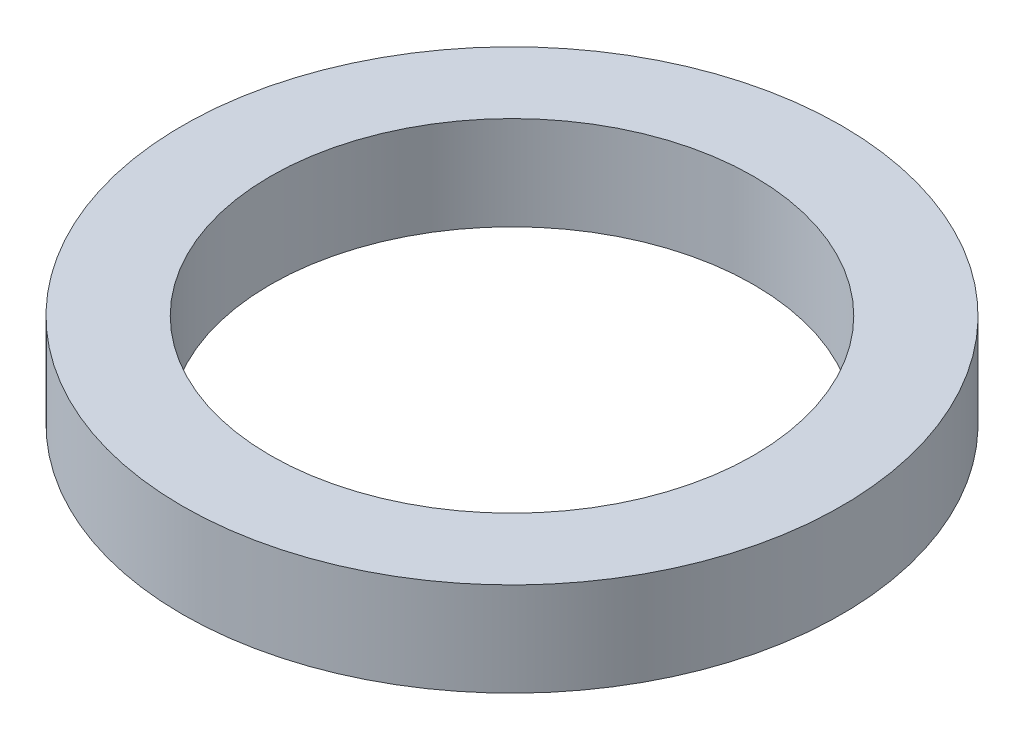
ISO-10303-21;
HEADER;
FILE_DESCRIPTION(('STEP AP214'),'2;1');
FILE_NAME('part.step','',(''),(''),'','','');
FILE_SCHEMA(('AUTOMOTIVE_DESIGN { 1 0 10303 214 1 1 1 1 }'));
ENDSEC;
DATA;
#1=APPLICATION_CONTEXT('core data for automotive mechanical design processes');
#2=APPLICATION_PROTOCOL_DEFINITION('international standard','automotive_design',2000,#1);
#3=PRODUCT_CONTEXT('',#1,'mechanical');
#4=PRODUCT('Part','Part','',(#3));
#5=PRODUCT_RELATED_PRODUCT_CATEGORY('part','',(#4));
#6=PRODUCT_DEFINITION_FORMATION('','',#4);
#7=PRODUCT_DEFINITION_CONTEXT('part definition',#1,'design');
#8=PRODUCT_DEFINITION('design','',#6,#7);
#9=PRODUCT_DEFINITION_SHAPE('','',#8);
#10=(LENGTH_UNIT() NAMED_UNIT(*) SI_UNIT(.MILLI.,.METRE.));
#11=(NAMED_UNIT(*) PLANE_ANGLE_UNIT() SI_UNIT($,.RADIAN.));
#12=(NAMED_UNIT(*) SI_UNIT($,.STERADIAN.) SOLID_ANGLE_UNIT());
#13=UNCERTAINTY_MEASURE_WITH_UNIT(LENGTH_MEASURE(1.E-05),#10,'distance_accuracy_value','');
#14=(GEOMETRIC_REPRESENTATION_CONTEXT(3) GLOBAL_UNCERTAINTY_ASSIGNED_CONTEXT((#13)) GLOBAL_UNIT_ASSIGNED_CONTEXT((#10,
#11,#12)) REPRESENTATION_CONTEXT('',''));
#15=CARTESIAN_POINT('',(0.,0.,0.));
#16=DIRECTION('',(0.,0.,1.));
#17=DIRECTION('',(1.,0.,0.));
#18=AXIS2_PLACEMENT_3D('',#15,#16,#17);
#19=CARTESIAN_POINT('',(0.,8.128,0.));
#20=DIRECTION('',(0.,1.,0.));
#21=DIRECTION('',(0.,0.,1.));
#22=AXIS2_PLACEMENT_3D('',#19,#20,#21);
#23=PLANE('',#22);
#24=CARTESIAN_POINT('',(0.,8.128,0.));
#25=DIRECTION('',(0.,1.,0.));
#26=DIRECTION('',(0.,0.,1.));
#27=AXIS2_PLACEMENT_3D('',#24,#25,#26);
#28=CIRCLE('',#27,28.575);
#29=CARTESIAN_POINT('',(0.,8.128,28.575));
#30=VERTEX_POINT('',#29);
#31=EDGE_CURVE('E10',#30,#30,#28,.T.);
#32=ORIENTED_EDGE('',*,*,#31,.T.);
#33=EDGE_LOOP('',(#32));
#34=FACE_BOUND('',#33,.T.);
#35=CARTESIAN_POINT('',(0.,8.128,0.));
#36=DIRECTION('',(0.,1.,0.));
#37=DIRECTION('',(0.,0.,1.));
#38=AXIS2_PLACEMENT_3D('',#35,#36,#37);
#39=CIRCLE('',#38,20.955);
#40=CARTESIAN_POINT('',(0.,8.128,20.955));
#41=VERTEX_POINT('',#40);
#42=EDGE_CURVE('E42',#41,#41,#39,.T.);
#43=ORIENTED_EDGE('',*,*,#42,.F.);
#44=EDGE_LOOP('',(#43));
#45=FACE_BOUND('',#44,.T.);
#46=ADVANCED_FACE('F31',(#34,#45),#23,.T.);
#47=CARTESIAN_POINT('',(0.,0.,0.));
#48=DIRECTION('',(0.,1.,0.));
#49=DIRECTION('',(0.,0.,1.));
#50=AXIS2_PLACEMENT_3D('',#47,#48,#49);
#51=PLANE('',#50);
#52=CARTESIAN_POINT('',(0.,0.,0.));
#53=DIRECTION('',(0.,1.,0.));
#54=DIRECTION('',(0.,0.,1.));
#55=AXIS2_PLACEMENT_3D('',#52,#53,#54);
#56=CIRCLE('',#55,28.575);
#57=CARTESIAN_POINT('',(0.,0.,28.575));
#58=VERTEX_POINT('',#57);
#59=EDGE_CURVE('E35',#58,#58,#56,.T.);
#60=ORIENTED_EDGE('',*,*,#59,.F.);
#61=EDGE_LOOP('',(#60));
#62=FACE_BOUND('',#61,.T.);
#63=CARTESIAN_POINT('',(0.,0.,0.));
#64=DIRECTION('',(0.,1.,0.));
#65=DIRECTION('',(0.,0.,1.));
#66=AXIS2_PLACEMENT_3D('',#63,#64,#65);
#67=CIRCLE('',#66,20.955);
#68=CARTESIAN_POINT('',(0.,0.,20.955));
#69=VERTEX_POINT('',#68);
#70=EDGE_CURVE('E44',#69,#69,#67,.T.);
#71=ORIENTED_EDGE('',*,*,#70,.T.);
#72=EDGE_LOOP('',(#71));
#73=FACE_BOUND('',#72,.T.);
#74=ADVANCED_FACE('F54',(#62,#73),#51,.F.);
#75=CARTESIAN_POINT('',(0.,8.128,0.));
#76=DIRECTION('',(0.,-1.,0.));
#77=DIRECTION('',(0.,0.,-1.));
#78=AXIS2_PLACEMENT_3D('',#75,#76,#77);
#79=CYLINDRICAL_SURFACE('',#78,28.575);
#80=ORIENTED_EDGE('',*,*,#31,.F.);
#81=EDGE_LOOP('',(#80));
#82=FACE_BOUND('',#81,.T.);
#83=ORIENTED_EDGE('',*,*,#59,.T.);
#84=EDGE_LOOP('',(#83));
#85=FACE_BOUND('',#84,.T.);
#86=ADVANCED_FACE('F33',(#82,#85),#79,.T.);
#87=CARTESIAN_POINT('',(0.,8.128,0.));
#88=DIRECTION('',(0.,-1.,0.));
#89=DIRECTION('',(0.,0.,-1.));
#90=AXIS2_PLACEMENT_3D('',#87,#88,#89);
#91=CYLINDRICAL_SURFACE('',#90,20.955);
#92=ORIENTED_EDGE('',*,*,#42,.T.);
#93=EDGE_LOOP('',(#92));
#94=FACE_BOUND('',#93,.T.);
#95=ORIENTED_EDGE('',*,*,#70,.F.);
#96=EDGE_LOOP('',(#95));
#97=FACE_BOUND('',#96,.T.);
#98=ADVANCED_FACE('F50',(#94,#97),#91,.F.);
#99=CLOSED_SHELL('',(#46,#74,#86,#98));
#100=MANIFOLD_SOLID_BREP('B2',#99);
#101=ADVANCED_BREP_SHAPE_REPRESENTATION('',(#18,#100),#14);
#102=SHAPE_DEFINITION_REPRESENTATION(#9,#101);
ENDSEC;
END-ISO-10303-21;
